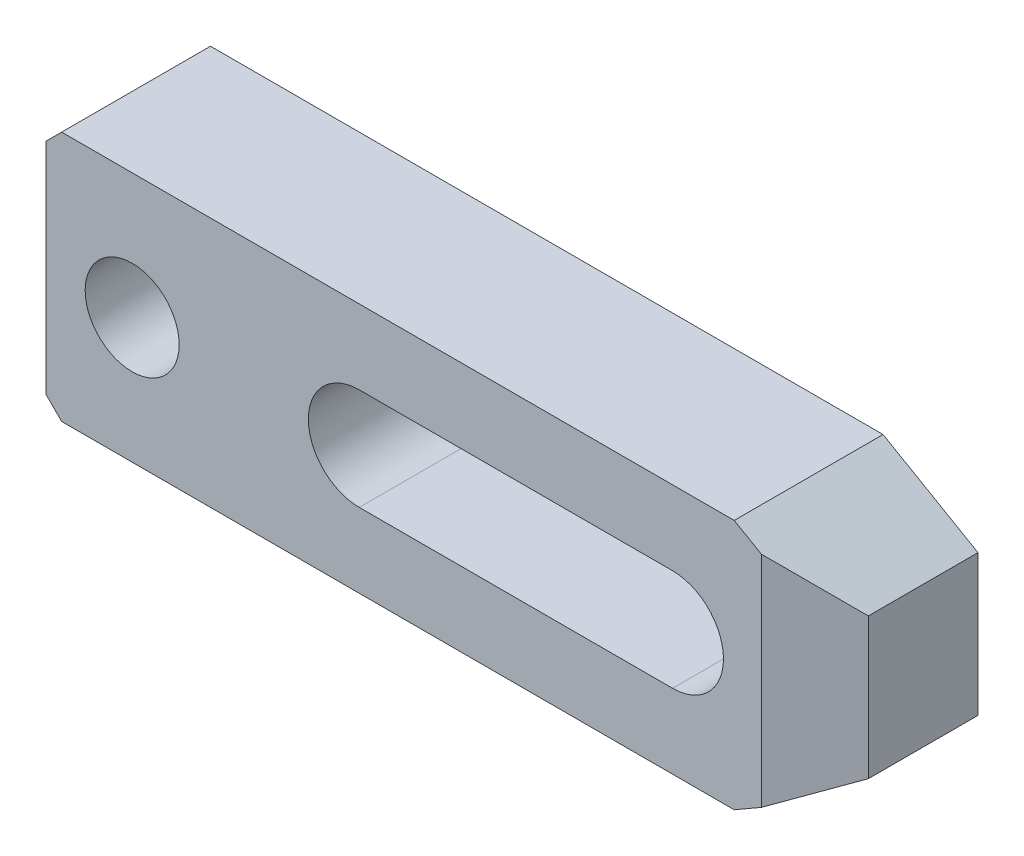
ISO-10303-21;
HEADER;
FILE_DESCRIPTION(('STEP AP214'),'2;1');
FILE_NAME('part.step','',(''),(''),'','','');
FILE_SCHEMA(('AUTOMOTIVE_DESIGN { 1 0 10303 214 1 1 1 1 }'));
ENDSEC;
DATA;
#1=APPLICATION_CONTEXT('core data for automotive mechanical design processes');
#2=APPLICATION_PROTOCOL_DEFINITION('international standard','automotive_design',2000,#1);
#3=PRODUCT_CONTEXT('',#1,'mechanical');
#4=PRODUCT('Part','Part','',(#3));
#5=PRODUCT_RELATED_PRODUCT_CATEGORY('part','',(#4));
#6=PRODUCT_DEFINITION_FORMATION('','',#4);
#7=PRODUCT_DEFINITION_CONTEXT('part definition',#1,'design');
#8=PRODUCT_DEFINITION('design','',#6,#7);
#9=PRODUCT_DEFINITION_SHAPE('','',#8);
#10=(LENGTH_UNIT() NAMED_UNIT(*) SI_UNIT(.MILLI.,.METRE.));
#11=(NAMED_UNIT(*) PLANE_ANGLE_UNIT() SI_UNIT($,.RADIAN.));
#12=(NAMED_UNIT(*) SI_UNIT($,.STERADIAN.) SOLID_ANGLE_UNIT());
#13=UNCERTAINTY_MEASURE_WITH_UNIT(LENGTH_MEASURE(1.E-05),#10,'distance_accuracy_value','');
#14=(GEOMETRIC_REPRESENTATION_CONTEXT(3) GLOBAL_UNCERTAINTY_ASSIGNED_CONTEXT((#13)) GLOBAL_UNIT_ASSIGNED_CONTEXT((#10,
#11,#12)) REPRESENTATION_CONTEXT('',''));
#15=CARTESIAN_POINT('',(0.,0.,0.));
#16=DIRECTION('',(0.,0.,1.));
#17=DIRECTION('',(1.,0.,0.));
#18=AXIS2_PLACEMENT_3D('',#15,#16,#17);
#19=CARTESIAN_POINT('',(-46.5673326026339,47.4326673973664,0.));
#20=DIRECTION('',(0.,0.,1.));
#21=DIRECTION('',(-1.,0.,0.));
#22=AXIS2_PLACEMENT_3D('',#19,#20,#21);
#23=PLANE('',#22);
#24=DIRECTION('',(0.,1.,0.));
#25=VECTOR('',#24,1.);
#26=CARTESIAN_POINT('',(-80.,-14.,0.));
#27=LINE('',#26,#25);
#28=CARTESIAN_POINT('',(-80.,-14.,0.));
#29=VERTEX_POINT('',#28);
#30=CARTESIAN_POINT('',(-80.,-6.5,0.));
#31=VERTEX_POINT('',#30);
#32=EDGE_CURVE('E147',#29,#31,#27,.T.);
#33=ORIENTED_EDGE('',*,*,#32,.T.);
#34=DIRECTION('',(-1.,0.,0.));
#35=VECTOR('',#34,1.);
#36=CARTESIAN_POINT('',(0.,-6.5,0.));
#37=LINE('',#36,#35);
#38=CARTESIAN_POINT('',(0.,-6.5,0.));
#39=VERTEX_POINT('',#38);
#40=EDGE_CURVE('E237',#39,#31,#37,.T.);
#41=ORIENTED_EDGE('',*,*,#40,.F.);
#42=CARTESIAN_POINT('',(0.,0.,0.));
#43=DIRECTION('',(0.,0.,1.));
#44=DIRECTION('',(-1.,0.,0.));
#45=AXIS2_PLACEMENT_3D('',#42,#43,#44);
#46=CIRCLE('',#45,6.5);
#47=CARTESIAN_POINT('',(0.,6.5,0.));
#48=VERTEX_POINT('',#47);
#49=EDGE_CURVE('E129',#39,#48,#46,.T.);
#50=ORIENTED_EDGE('',*,*,#49,.T.);
#51=DIRECTION('',(1.,0.,0.));
#52=VECTOR('',#51,1.);
#53=CARTESIAN_POINT('',(-40.,6.5,0.));
#54=LINE('',#53,#52);
#55=CARTESIAN_POINT('',(-80.,6.5,0.));
#56=VERTEX_POINT('',#55);
#57=EDGE_CURVE('E120',#56,#48,#54,.T.);
#58=ORIENTED_EDGE('',*,*,#57,.F.);
#59=CARTESIAN_POINT('',(-80.,14.,0.));
#60=VERTEX_POINT('',#59);
#61=EDGE_CURVE('E125',#56,#60,#27,.T.);
#62=ORIENTED_EDGE('',*,*,#61,.T.);
#63=DIRECTION('',(-0.707106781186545,-0.707106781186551,0.));
#64=VECTOR('',#63,1.);
#65=CARTESIAN_POINT('',(-78.,16.,0.));
#66=LINE('',#65,#64);
#67=CARTESIAN_POINT('',(-78.,16.,0.));
#68=VERTEX_POINT('',#67);
#69=EDGE_CURVE('E148',#68,#60,#66,.T.);
#70=ORIENTED_EDGE('',*,*,#69,.F.);
#71=DIRECTION('',(-1.,0.,0.));
#72=VECTOR('',#71,1.);
#73=CARTESIAN_POINT('',(7.87564434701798,16.,0.));
#74=LINE('',#73,#72);
#75=CARTESIAN_POINT('',(7.87564434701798,16.,0.));
#76=VERTEX_POINT('',#75);
#77=EDGE_CURVE('E151',#76,#68,#74,.T.);
#78=ORIENTED_EDGE('',*,*,#77,.F.);
#79=DIRECTION('',(-0.866025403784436,0.5,0.));
#80=VECTOR('',#79,1.);
#81=CARTESIAN_POINT('',(20.,9.,0.));
#82=LINE('',#81,#80);
#83=CARTESIAN_POINT('',(20.,9.,0.));
#84=VERTEX_POINT('',#83);
#85=EDGE_CURVE('E158',#84,#76,#82,.T.);
#86=ORIENTED_EDGE('',*,*,#85,.F.);
#87=DIRECTION('',(0.,-1.,0.));
#88=VECTOR('',#87,1.);
#89=CARTESIAN_POINT('',(20.,9.,0.));
#90=LINE('',#89,#88);
#91=CARTESIAN_POINT('',(20.,-9.,0.));
#92=VERTEX_POINT('',#91);
#93=EDGE_CURVE('E181',#84,#92,#90,.T.);
#94=ORIENTED_EDGE('',*,*,#93,.T.);
#95=DIRECTION('',(-0.86602540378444,-0.5,0.));
#96=VECTOR('',#95,1.);
#97=CARTESIAN_POINT('',(20.,-9.,0.));
#98=LINE('',#97,#96);
#99=CARTESIAN_POINT('',(7.8756443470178,-16.,0.));
#100=VERTEX_POINT('',#99);
#101=EDGE_CURVE('E208',#92,#100,#98,.T.);
#102=ORIENTED_EDGE('',*,*,#101,.T.);
#103=DIRECTION('',(-1.,0.,0.));
#104=VECTOR('',#103,1.);
#105=CARTESIAN_POINT('',(7.8756443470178,-16.,0.));
#106=LINE('',#105,#104);
#107=CARTESIAN_POINT('',(-78.,-16.,0.));
#108=VERTEX_POINT('',#107);
#109=EDGE_CURVE('E210',#100,#108,#106,.T.);
#110=ORIENTED_EDGE('',*,*,#109,.T.);
#111=DIRECTION('',(-0.707106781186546,0.707106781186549,0.));
#112=VECTOR('',#111,1.);
#113=CARTESIAN_POINT('',(-78.,-16.,0.));
#114=LINE('',#113,#112);
#115=EDGE_CURVE('E150',#108,#29,#114,.T.);
#116=ORIENTED_EDGE('',*,*,#115,.T.);
#117=EDGE_LOOP('',(#33,#41,#50,#58,#62,#70,#78,#86,#94,#102,#110,#116));
#118=FACE_BOUND('',#117,.T.);
#119=ADVANCED_FACE('F14',(#118),#23,.F.);
#120=CARTESIAN_POINT('',(-80.,-14.,19.));
#121=DIRECTION('',(-1.,0.,0.));
#122=DIRECTION('',(0.,0.,-1.));
#123=AXIS2_PLACEMENT_3D('',#120,#121,#122);
#124=PLANE('',#123);
#125=DIRECTION('',(0.,-1.,0.));
#126=VECTOR('',#125,1.);
#127=CARTESIAN_POINT('',(-80.,-14.,5.));
#128=LINE('',#127,#126);
#129=CARTESIAN_POINT('',(-80.,6.5,5.));
#130=VERTEX_POINT('',#129);
#131=CARTESIAN_POINT('',(-80.,-6.5,5.));
#132=VERTEX_POINT('',#131);
#133=EDGE_CURVE('E141',#130,#132,#128,.T.);
#134=ORIENTED_EDGE('',*,*,#133,.T.);
#135=DIRECTION('',(0.,0.,-1.));
#136=VECTOR('',#135,1.);
#137=CARTESIAN_POINT('',(-80.,-6.5,19.));
#138=LINE('',#137,#136);
#139=EDGE_CURVE('E140',#132,#31,#138,.T.);
#140=ORIENTED_EDGE('',*,*,#139,.T.);
#141=ORIENTED_EDGE('',*,*,#32,.F.);
#142=DIRECTION('',(0.,0.,-1.));
#143=VECTOR('',#142,1.);
#144=CARTESIAN_POINT('',(-80.,-14.,19.));
#145=LINE('',#144,#143);
#146=CARTESIAN_POINT('',(-80.,-14.,19.));
#147=VERTEX_POINT('',#146);
#148=EDGE_CURVE('E189',#147,#29,#145,.T.);
#149=ORIENTED_EDGE('',*,*,#148,.F.);
#150=DIRECTION('',(0.,1.,0.));
#151=VECTOR('',#150,1.);
#152=CARTESIAN_POINT('',(-80.,-14.,19.));
#153=LINE('',#152,#151);
#154=CARTESIAN_POINT('',(-80.,14.,19.));
#155=VERTEX_POINT('',#154);
#156=EDGE_CURVE('E171',#147,#155,#153,.T.);
#157=ORIENTED_EDGE('',*,*,#156,.T.);
#158=DIRECTION('',(0.,0.,-1.));
#159=VECTOR('',#158,1.);
#160=CARTESIAN_POINT('',(-80.,14.,19.));
#161=LINE('',#160,#159);
#162=EDGE_CURVE('E145',#155,#60,#161,.T.);
#163=ORIENTED_EDGE('',*,*,#162,.T.);
#164=ORIENTED_EDGE('',*,*,#61,.F.);
#165=DIRECTION('',(0.,0.,-1.));
#166=VECTOR('',#165,1.);
#167=CARTESIAN_POINT('',(-80.,6.5,19.));
#168=LINE('',#167,#166);
#169=EDGE_CURVE('E135',#130,#56,#168,.T.);
#170=ORIENTED_EDGE('',*,*,#169,.F.);
#171=EDGE_LOOP('',(#134,#140,#141,#149,#157,#163,#164,#170));
#172=FACE_BOUND('',#171,.T.);
#173=ADVANCED_FACE('F143',(#172),#124,.T.);
#174=CARTESIAN_POINT('',(-69.,0.,19.));
#175=DIRECTION('',(0.,0.,-1.));
#176=DIRECTION('',(1.,0.,0.));
#177=AXIS2_PLACEMENT_3D('',#174,#175,#176);
#178=CYLINDRICAL_SURFACE('',#177,6.);
#179=CARTESIAN_POINT('',(-69.,0.,19.));
#180=DIRECTION('',(0.,0.,1.));
#181=DIRECTION('',(-1.,0.,0.));
#182=AXIS2_PLACEMENT_3D('',#179,#180,#181);
#183=CIRCLE('',#182,6.);
#184=CARTESIAN_POINT('',(-75.,0.,19.));
#185=VERTEX_POINT('',#184);
#186=EDGE_CURVE('E161',#185,#185,#183,.T.);
#187=ORIENTED_EDGE('',*,*,#186,.T.);
#188=EDGE_LOOP('',(#187));
#189=FACE_BOUND('',#188,.T.);
#190=CARTESIAN_POINT('',(-69.,0.,5.));
#191=DIRECTION('',(0.,0.,-1.));
#192=DIRECTION('',(1.,0.,0.));
#193=AXIS2_PLACEMENT_3D('',#190,#191,#192);
#194=CIRCLE('',#193,6.);
#195=CARTESIAN_POINT('',(-63.,0.,5.));
#196=VERTEX_POINT('',#195);
#197=EDGE_CURVE('E425',#196,#196,#194,.T.);
#198=ORIENTED_EDGE('',*,*,#197,.T.);
#199=EDGE_LOOP('',(#198));
#200=FACE_BOUND('',#199,.T.);
#201=ADVANCED_FACE('F262',(#189,#200),#178,.F.);
#202=CARTESIAN_POINT('',(-40.,0.,19.));
#203=DIRECTION('',(0.,0.,-1.));
#204=DIRECTION('',(1.,0.,0.));
#205=AXIS2_PLACEMENT_3D('',#202,#203,#204);
#206=CYLINDRICAL_SURFACE('',#205,6.5);
#207=DIRECTION('',(0.,0.,-1.));
#208=VECTOR('',#207,1.);
#209=CARTESIAN_POINT('',(-40.,-6.5,19.));
#210=LINE('',#209,#208);
#211=CARTESIAN_POINT('',(-40.,-6.5,19.));
#212=VERTEX_POINT('',#211);
#213=CARTESIAN_POINT('',(-40.,-6.5,5.));
#214=VERTEX_POINT('',#213);
#215=EDGE_CURVE('E256',#212,#214,#210,.T.);
#216=ORIENTED_EDGE('',*,*,#215,.T.);
#217=CARTESIAN_POINT('',(-40.,0.,5.));
#218=DIRECTION('',(0.,0.,-1.));
#219=DIRECTION('',(1.,0.,0.));
#220=AXIS2_PLACEMENT_3D('',#217,#218,#219);
#221=CIRCLE('',#220,6.5);
#222=CARTESIAN_POINT('',(-40.,6.5,5.));
#223=VERTEX_POINT('',#222);
#224=EDGE_CURVE('E278',#214,#223,#221,.T.);
#225=ORIENTED_EDGE('',*,*,#224,.T.);
#226=DIRECTION('',(0.,0.,-1.));
#227=VECTOR('',#226,1.);
#228=CARTESIAN_POINT('',(-40.,6.5,19.));
#229=LINE('',#228,#227);
#230=CARTESIAN_POINT('',(-40.,6.5,19.));
#231=VERTEX_POINT('',#230);
#232=EDGE_CURVE('E244',#231,#223,#229,.T.);
#233=ORIENTED_EDGE('',*,*,#232,.F.);
#234=CARTESIAN_POINT('',(-40.,0.,19.));
#235=DIRECTION('',(0.,0.,1.));
#236=DIRECTION('',(-1.,0.,0.));
#237=AXIS2_PLACEMENT_3D('',#234,#235,#236);
#238=CIRCLE('',#237,6.5);
#239=EDGE_CURVE('E132',#231,#212,#238,.T.);
#240=ORIENTED_EDGE('',*,*,#239,.T.);
#241=EDGE_LOOP('',(#216,#225,#233,#240));
#242=FACE_BOUND('',#241,.T.);
#243=ADVANCED_FACE('F269',(#242),#206,.F.);
#244=CARTESIAN_POINT('',(-46.5673326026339,47.4326673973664,19.));
#245=DIRECTION('',(0.,0.,1.));
#246=DIRECTION('',(-1.,0.,0.));
#247=AXIS2_PLACEMENT_3D('',#244,#245,#246);
#248=PLANE('',#247);
#249=DIRECTION('',(0.,-1.,0.));
#250=VECTOR('',#249,1.);
#251=CARTESIAN_POINT('',(11.3397459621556,47.4326673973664,19.));
#252=LINE('',#251,#250);
#253=CARTESIAN_POINT('',(11.3397459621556,14.,19.));
#254=VERTEX_POINT('',#253);
#255=CARTESIAN_POINT('',(11.3397459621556,-14.,19.));
#256=VERTEX_POINT('',#255);
#257=EDGE_CURVE('E233',#254,#256,#252,.T.);
#258=ORIENTED_EDGE('',*,*,#257,.F.);
#259=DIRECTION('',(-0.866025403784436,0.5,0.));
#260=VECTOR('',#259,1.);
#261=CARTESIAN_POINT('',(20.,9.,19.));
#262=LINE('',#261,#260);
#263=CARTESIAN_POINT('',(7.87564434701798,16.,19.));
#264=VERTEX_POINT('',#263);
#265=EDGE_CURVE('E179',#254,#264,#262,.T.);
#266=ORIENTED_EDGE('',*,*,#265,.T.);
#267=DIRECTION('',(-1.,0.,0.));
#268=VECTOR('',#267,1.);
#269=CARTESIAN_POINT('',(7.87564434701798,16.,19.));
#270=LINE('',#269,#268);
#271=CARTESIAN_POINT('',(-78.,16.,19.));
#272=VERTEX_POINT('',#271);
#273=EDGE_CURVE('E176',#264,#272,#270,.T.);
#274=ORIENTED_EDGE('',*,*,#273,.T.);
#275=DIRECTION('',(-0.707106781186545,-0.707106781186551,0.));
#276=VECTOR('',#275,1.);
#277=CARTESIAN_POINT('',(-78.,16.,19.));
#278=LINE('',#277,#276);
#279=EDGE_CURVE('E173',#272,#155,#278,.T.);
#280=ORIENTED_EDGE('',*,*,#279,.T.);
#281=ORIENTED_EDGE('',*,*,#156,.F.);
#282=DIRECTION('',(-0.707106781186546,0.707106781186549,0.));
#283=VECTOR('',#282,1.);
#284=CARTESIAN_POINT('',(-78.,-16.,19.));
#285=LINE('',#284,#283);
#286=CARTESIAN_POINT('',(-78.,-16.,19.));
#287=VERTEX_POINT('',#286);
#288=EDGE_CURVE('E168',#287,#147,#285,.T.);
#289=ORIENTED_EDGE('',*,*,#288,.F.);
#290=DIRECTION('',(-1.,0.,0.));
#291=VECTOR('',#290,1.);
#292=CARTESIAN_POINT('',(7.8756443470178,-16.,19.));
#293=LINE('',#292,#291);
#294=CARTESIAN_POINT('',(7.8756443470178,-16.,19.));
#295=VERTEX_POINT('',#294);
#296=EDGE_CURVE('E165',#295,#287,#293,.T.);
#297=ORIENTED_EDGE('',*,*,#296,.F.);
#298=DIRECTION('',(-0.86602540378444,-0.5,0.));
#299=VECTOR('',#298,1.);
#300=CARTESIAN_POINT('',(20.,-9.,19.));
#301=LINE('',#300,#299);
#302=EDGE_CURVE('E162',#256,#295,#301,.T.);
#303=ORIENTED_EDGE('',*,*,#302,.F.);
#304=EDGE_LOOP('',(#258,#266,#274,#280,#281,#289,#297,#303));
#305=FACE_BOUND('',#304,.T.);
#306=ORIENTED_EDGE('',*,*,#186,.F.);
#307=EDGE_LOOP('',(#306));
#308=FACE_BOUND('',#307,.T.);
#309=DIRECTION('',(-1.,0.,0.));
#310=VECTOR('',#309,1.);
#311=CARTESIAN_POINT('',(0.,-6.5,19.));
#312=LINE('',#311,#310);
#313=CARTESIAN_POINT('',(0.,-6.5,19.));
#314=VERTEX_POINT('',#313);
#315=EDGE_CURVE('E247',#314,#212,#312,.T.);
#316=ORIENTED_EDGE('',*,*,#315,.T.);
#317=ORIENTED_EDGE('',*,*,#239,.F.);
#318=DIRECTION('',(1.,0.,0.));
#319=VECTOR('',#318,1.);
#320=CARTESIAN_POINT('',(-40.,6.5,19.));
#321=LINE('',#320,#319);
#322=CARTESIAN_POINT('',(0.,6.5,19.));
#323=VERTEX_POINT('',#322);
#324=EDGE_CURVE('E241',#231,#323,#321,.T.);
#325=ORIENTED_EDGE('',*,*,#324,.T.);
#326=CARTESIAN_POINT('',(0.,0.,19.));
#327=DIRECTION('',(0.,0.,1.));
#328=DIRECTION('',(-1.,0.,0.));
#329=AXIS2_PLACEMENT_3D('',#326,#327,#328);
#330=CIRCLE('',#329,6.5);
#331=EDGE_CURVE('E245',#314,#323,#330,.T.);
#332=ORIENTED_EDGE('',*,*,#331,.F.);
#333=EDGE_LOOP('',(#316,#317,#325,#332));
#334=FACE_BOUND('',#333,.T.);
#335=ADVANCED_FACE('F265',(#305,#308,#334),#248,.T.);
#336=CARTESIAN_POINT('',(20.,9.,19.));
#337=DIRECTION('',(-0.5,-0.866025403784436,0.));
#338=DIRECTION('',(0.866025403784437,-0.5,0.));
#339=AXIS2_PLACEMENT_3D('',#336,#337,#338);
#340=PLANE('',#339);
#341=ORIENTED_EDGE('',*,*,#265,.F.);
#342=DIRECTION('',(0.774596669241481,-0.447213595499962,-0.447213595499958));
#343=VECTOR('',#342,1.);
#344=CARTESIAN_POINT('',(18.2679491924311,10.,15.));
#345=LINE('',#344,#343);
#346=CARTESIAN_POINT('',(20.,9.,14.));
#347=VERTEX_POINT('',#346);
#348=EDGE_CURVE('E235',#254,#347,#345,.T.);
#349=ORIENTED_EDGE('',*,*,#348,.T.);
#350=DIRECTION('',(0.,0.,-1.));
#351=VECTOR('',#350,1.);
#352=CARTESIAN_POINT('',(20.,9.,19.));
#353=LINE('',#352,#351);
#354=EDGE_CURVE('E164',#347,#84,#353,.T.);
#355=ORIENTED_EDGE('',*,*,#354,.T.);
#356=ORIENTED_EDGE('',*,*,#85,.T.);
#357=DIRECTION('',(0.,0.,-1.));
#358=VECTOR('',#357,1.);
#359=CARTESIAN_POINT('',(7.87564434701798,16.,19.));
#360=LINE('',#359,#358);
#361=EDGE_CURVE('E9',#264,#76,#360,.T.);
#362=ORIENTED_EDGE('',*,*,#361,.F.);
#363=EDGE_LOOP('',(#341,#349,#355,#356,#362));
#364=FACE_BOUND('',#363,.T.);
#365=ADVANCED_FACE('F268',(#364),#340,.F.);
#366=CARTESIAN_POINT('',(7.87564434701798,16.,19.));
#367=DIRECTION('',(0.,-1.,0.));
#368=DIRECTION('',(0.,0.,1.));
#369=AXIS2_PLACEMENT_3D('',#366,#367,#368);
#370=PLANE('',#369);
#371=DIRECTION('',(0.,0.,-1.));
#372=VECTOR('',#371,1.);
#373=CARTESIAN_POINT('',(-78.,16.,19.));
#374=LINE('',#373,#372);
#375=EDGE_CURVE('E22',#272,#68,#374,.T.);
#376=ORIENTED_EDGE('',*,*,#375,.F.);
#377=ORIENTED_EDGE('',*,*,#273,.F.);
#378=ORIENTED_EDGE('',*,*,#361,.T.);
#379=ORIENTED_EDGE('',*,*,#77,.T.);
#380=EDGE_LOOP('',(#376,#377,#378,#379));
#381=FACE_BOUND('',#380,.T.);
#382=ADVANCED_FACE('F16',(#381),#370,.F.);
#383=CARTESIAN_POINT('',(-78.,16.,19.));
#384=DIRECTION('',(0.707106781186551,-0.707106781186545,0.));
#385=DIRECTION('',(0.707106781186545,0.707106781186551,0.));
#386=AXIS2_PLACEMENT_3D('',#383,#384,#385);
#387=PLANE('',#386);
#388=ORIENTED_EDGE('',*,*,#162,.F.);
#389=ORIENTED_EDGE('',*,*,#279,.F.);
#390=ORIENTED_EDGE('',*,*,#375,.T.);
#391=ORIENTED_EDGE('',*,*,#69,.T.);
#392=EDGE_LOOP('',(#388,#389,#390,#391));
#393=FACE_BOUND('',#392,.T.);
#394=ADVANCED_FACE('F193',(#393),#387,.F.);
#395=CARTESIAN_POINT('',(-78.,-16.,19.));
#396=DIRECTION('',(-0.707106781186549,-0.707106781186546,0.));
#397=DIRECTION('',(0.707106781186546,-0.707106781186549,0.));
#398=AXIS2_PLACEMENT_3D('',#395,#396,#397);
#399=PLANE('',#398);
#400=DIRECTION('',(0.,0.,-1.));
#401=VECTOR('',#400,1.);
#402=CARTESIAN_POINT('',(-78.,-16.,19.));
#403=LINE('',#402,#401);
#404=EDGE_CURVE('E187',#287,#108,#403,.T.);
#405=ORIENTED_EDGE('',*,*,#404,.F.);
#406=ORIENTED_EDGE('',*,*,#288,.T.);
#407=ORIENTED_EDGE('',*,*,#148,.T.);
#408=ORIENTED_EDGE('',*,*,#115,.F.);
#409=EDGE_LOOP('',(#405,#406,#407,#408));
#410=FACE_BOUND('',#409,.T.);
#411=ADVANCED_FACE('F220',(#410),#399,.T.);
#412=CARTESIAN_POINT('',(7.8756443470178,-16.,19.));
#413=DIRECTION('',(0.,-1.,0.));
#414=DIRECTION('',(0.,0.,1.));
#415=AXIS2_PLACEMENT_3D('',#412,#413,#414);
#416=PLANE('',#415);
#417=DIRECTION('',(0.,0.,-1.));
#418=VECTOR('',#417,1.);
#419=CARTESIAN_POINT('',(7.8756443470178,-16.,19.));
#420=LINE('',#419,#418);
#421=EDGE_CURVE('E185',#295,#100,#420,.T.);
#422=ORIENTED_EDGE('',*,*,#421,.F.);
#423=ORIENTED_EDGE('',*,*,#296,.T.);
#424=ORIENTED_EDGE('',*,*,#404,.T.);
#425=ORIENTED_EDGE('',*,*,#109,.F.);
#426=EDGE_LOOP('',(#422,#423,#424,#425));
#427=FACE_BOUND('',#426,.T.);
#428=ADVANCED_FACE('F306',(#427),#416,.T.);
#429=CARTESIAN_POINT('',(20.,-9.,19.));
#430=DIRECTION('',(0.5,-0.86602540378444,0.));
#431=DIRECTION('',(0.86602540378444,0.5,0.));
#432=AXIS2_PLACEMENT_3D('',#429,#430,#431);
#433=PLANE('',#432);
#434=DIRECTION('',(0.774596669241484,0.447213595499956,-0.44721359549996));
#435=VECTOR('',#434,1.);
#436=CARTESIAN_POINT('',(18.2679491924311,-10.,15.));
#437=LINE('',#436,#435);
#438=CARTESIAN_POINT('',(20.,-9.,14.));
#439=VERTEX_POINT('',#438);
#440=EDGE_CURVE('E37',#256,#439,#437,.T.);
#441=ORIENTED_EDGE('',*,*,#440,.F.);
#442=ORIENTED_EDGE('',*,*,#302,.T.);
#443=ORIENTED_EDGE('',*,*,#421,.T.);
#444=ORIENTED_EDGE('',*,*,#101,.F.);
#445=DIRECTION('',(0.,0.,-1.));
#446=VECTOR('',#445,1.);
#447=CARTESIAN_POINT('',(20.,-9.,19.));
#448=LINE('',#447,#446);
#449=EDGE_CURVE('E183',#439,#92,#448,.T.);
#450=ORIENTED_EDGE('',*,*,#449,.F.);
#451=EDGE_LOOP('',(#441,#442,#443,#444,#450));
#452=FACE_BOUND('',#451,.T.);
#453=ADVANCED_FACE('F303',(#452),#433,.T.);
#454=CARTESIAN_POINT('',(20.,9.,19.));
#455=DIRECTION('',(1.,0.,0.));
#456=DIRECTION('',(0.,0.,1.));
#457=AXIS2_PLACEMENT_3D('',#454,#455,#456);
#458=PLANE('',#457);
#459=DIRECTION('',(0.,-1.,0.));
#460=VECTOR('',#459,1.);
#461=CARTESIAN_POINT('',(20.,20.,14.));
#462=LINE('',#461,#460);
#463=EDGE_CURVE('E227',#347,#439,#462,.T.);
#464=ORIENTED_EDGE('',*,*,#463,.T.);
#465=ORIENTED_EDGE('',*,*,#449,.T.);
#466=ORIENTED_EDGE('',*,*,#93,.F.);
#467=ORIENTED_EDGE('',*,*,#354,.F.);
#468=EDGE_LOOP('',(#464,#465,#466,#467));
#469=FACE_BOUND('',#468,.T.);
#470=ADVANCED_FACE('F205',(#469),#458,.T.);
#471=CARTESIAN_POINT('',(0.,-6.5,19.));
#472=DIRECTION('',(0.,-1.,0.));
#473=DIRECTION('',(1.,0.,0.));
#474=AXIS2_PLACEMENT_3D('',#471,#472,#473);
#475=PLANE('',#474);
#476=ORIENTED_EDGE('',*,*,#40,.T.);
#477=ORIENTED_EDGE('',*,*,#139,.F.);
#478=DIRECTION('',(1.,0.,0.));
#479=VECTOR('',#478,1.);
#480=CARTESIAN_POINT('',(-90.,-6.5,5.));
#481=LINE('',#480,#479);
#482=EDGE_CURVE('E276',#132,#214,#481,.T.);
#483=ORIENTED_EDGE('',*,*,#482,.T.);
#484=ORIENTED_EDGE('',*,*,#215,.F.);
#485=ORIENTED_EDGE('',*,*,#315,.F.);
#486=DIRECTION('',(0.,0.,-1.));
#487=VECTOR('',#486,1.);
#488=CARTESIAN_POINT('',(0.,-6.5,19.));
#489=LINE('',#488,#487);
#490=EDGE_CURVE('E255',#314,#39,#489,.T.);
#491=ORIENTED_EDGE('',*,*,#490,.T.);
#492=EDGE_LOOP('',(#476,#477,#483,#484,#485,#491));
#493=FACE_BOUND('',#492,.T.);
#494=ADVANCED_FACE('F275',(#493),#475,.F.);
#495=CARTESIAN_POINT('',(0.,0.,19.));
#496=DIRECTION('',(0.,0.,-1.));
#497=DIRECTION('',(1.,0.,0.));
#498=AXIS2_PLACEMENT_3D('',#495,#496,#497);
#499=CYLINDRICAL_SURFACE('',#498,6.5);
#500=DIRECTION('',(0.,0.,-1.));
#501=VECTOR('',#500,1.);
#502=CARTESIAN_POINT('',(0.,6.5,19.));
#503=LINE('',#502,#501);
#504=EDGE_CURVE('E253',#323,#48,#503,.T.);
#505=ORIENTED_EDGE('',*,*,#504,.T.);
#506=ORIENTED_EDGE('',*,*,#49,.F.);
#507=ORIENTED_EDGE('',*,*,#490,.F.);
#508=ORIENTED_EDGE('',*,*,#331,.T.);
#509=EDGE_LOOP('',(#505,#506,#507,#508));
#510=FACE_BOUND('',#509,.T.);
#511=ADVANCED_FACE('F280',(#510),#499,.F.);
#512=CARTESIAN_POINT('',(-40.,6.5,19.));
#513=DIRECTION('',(0.,1.,0.));
#514=DIRECTION('',(-1.,0.,0.));
#515=AXIS2_PLACEMENT_3D('',#512,#513,#514);
#516=PLANE('',#515);
#517=ORIENTED_EDGE('',*,*,#57,.T.);
#518=ORIENTED_EDGE('',*,*,#504,.F.);
#519=ORIENTED_EDGE('',*,*,#324,.F.);
#520=ORIENTED_EDGE('',*,*,#232,.T.);
#521=DIRECTION('',(1.,0.,0.));
#522=VECTOR('',#521,1.);
#523=CARTESIAN_POINT('',(-90.,6.5,5.));
#524=LINE('',#523,#522);
#525=EDGE_CURVE('E29',#130,#223,#524,.T.);
#526=ORIENTED_EDGE('',*,*,#525,.F.);
#527=ORIENTED_EDGE('',*,*,#169,.T.);
#528=EDGE_LOOP('',(#517,#518,#519,#520,#526,#527));
#529=FACE_BOUND('',#528,.T.);
#530=ADVANCED_FACE('F136',(#529),#516,.F.);
#531=CARTESIAN_POINT('',(7.875644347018,20.,21.));
#532=DIRECTION('',(-0.5,0.,-0.866025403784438));
#533=DIRECTION('',(0.866025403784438,0.,-0.5));
#534=AXIS2_PLACEMENT_3D('',#531,#532,#533);
#535=PLANE('',#534);
#536=ORIENTED_EDGE('',*,*,#257,.T.);
#537=ORIENTED_EDGE('',*,*,#440,.T.);
#538=ORIENTED_EDGE('',*,*,#463,.F.);
#539=ORIENTED_EDGE('',*,*,#348,.F.);
#540=EDGE_LOOP('',(#536,#537,#538,#539));
#541=FACE_BOUND('',#540,.T.);
#542=ADVANCED_FACE('F288',(#541),#535,.F.);
#543=CARTESIAN_POINT('',(-90.,-6.5,5.));
#544=DIRECTION('',(0.,0.,-1.));
#545=DIRECTION('',(1.,0.,0.));
#546=AXIS2_PLACEMENT_3D('',#543,#544,#545);
#547=PLANE('',#546);
#548=ORIENTED_EDGE('',*,*,#197,.F.);
#549=EDGE_LOOP('',(#548));
#550=FACE_BOUND('',#549,.T.);
#551=ORIENTED_EDGE('',*,*,#525,.T.);
#552=ORIENTED_EDGE('',*,*,#224,.F.);
#553=ORIENTED_EDGE('',*,*,#482,.F.);
#554=ORIENTED_EDGE('',*,*,#133,.F.);
#555=EDGE_LOOP('',(#551,#552,#553,#554));
#556=FACE_BOUND('',#555,.T.);
#557=ADVANCED_FACE('F410',(#550,#556),#547,.T.);
#558=CLOSED_SHELL('',(#119,#173,#201,#243,#335,#365,#382,#394,#411,#428,#453,#470,#494,#511,
#530,#542,#557));
#559=MANIFOLD_SOLID_BREP('B1',#558);
#560=ADVANCED_BREP_SHAPE_REPRESENTATION('',(#18,#559),#14);
#561=SHAPE_DEFINITION_REPRESENTATION(#9,#560);
ENDSEC;
END-ISO-10303-21;
